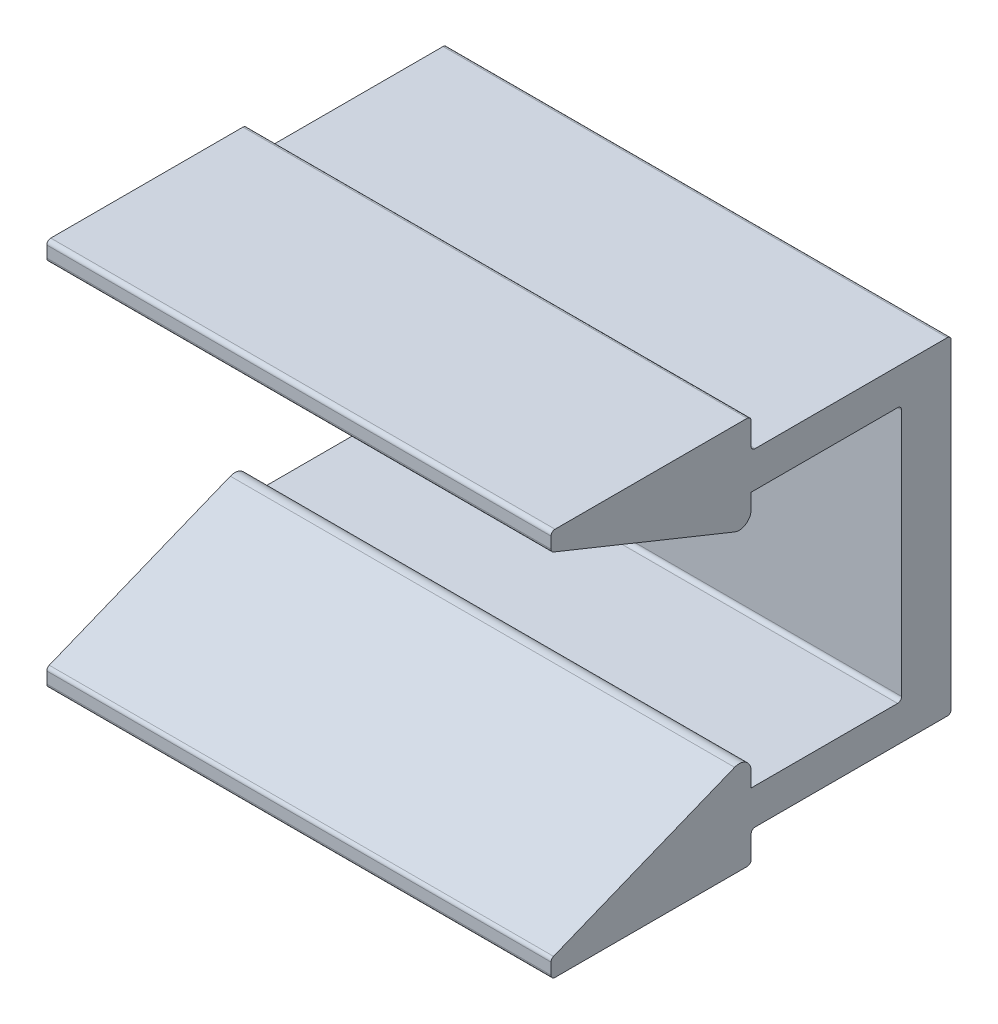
ISO-10303-21;
HEADER;
FILE_DESCRIPTION(('STEP AP214'),'2;1');
FILE_NAME('part.step','',(''),(''),'','','');
FILE_SCHEMA(('AUTOMOTIVE_DESIGN { 1 0 10303 214 1 1 1 1 }'));
ENDSEC;
DATA;
#1=APPLICATION_CONTEXT('core data for automotive mechanical design processes');
#2=APPLICATION_PROTOCOL_DEFINITION('international standard','automotive_design',2000,#1);
#3=PRODUCT_CONTEXT('',#1,'mechanical');
#4=PRODUCT('Part','Part','',(#3));
#5=PRODUCT_RELATED_PRODUCT_CATEGORY('part','',(#4));
#6=PRODUCT_DEFINITION_FORMATION('','',#4);
#7=PRODUCT_DEFINITION_CONTEXT('part definition',#1,'design');
#8=PRODUCT_DEFINITION('design','',#6,#7);
#9=PRODUCT_DEFINITION_SHAPE('','',#8);
#10=(LENGTH_UNIT() NAMED_UNIT(*) SI_UNIT(.MILLI.,.METRE.));
#11=(NAMED_UNIT(*) PLANE_ANGLE_UNIT() SI_UNIT($,.RADIAN.));
#12=(NAMED_UNIT(*) SI_UNIT($,.STERADIAN.) SOLID_ANGLE_UNIT());
#13=UNCERTAINTY_MEASURE_WITH_UNIT(LENGTH_MEASURE(1.E-05),#10,'distance_accuracy_value','');
#14=(GEOMETRIC_REPRESENTATION_CONTEXT(3) GLOBAL_UNCERTAINTY_ASSIGNED_CONTEXT((#13)) GLOBAL_UNIT_ASSIGNED_CONTEXT((#10,
#11,#12)) REPRESENTATION_CONTEXT('',''));
#15=CARTESIAN_POINT('',(0.,0.,0.));
#16=DIRECTION('',(0.,0.,1.));
#17=DIRECTION('',(1.,0.,0.));
#18=AXIS2_PLACEMENT_3D('',#15,#16,#17);
#19=CARTESIAN_POINT('',(8.001,-5.207,0.));
#20=DIRECTION('',(0.,0.,1.));
#21=DIRECTION('',(1.,0.,0.));
#22=AXIS2_PLACEMENT_3D('',#19,#20,#21);
#23=PLANE('',#22);
#24=DIRECTION('',(0.,1.,0.));
#25=VECTOR('',#24,1.);
#26=CARTESIAN_POINT('',(8.001,-5.207,0.));
#27=LINE('',#26,#25);
#28=CARTESIAN_POINT('',(8.001,-5.073,0.));
#29=VERTEX_POINT('',#28);
#30=CARTESIAN_POINT('',(8.001,5.073,0.));
#31=VERTEX_POINT('',#30);
#32=EDGE_CURVE('E361',#29,#31,#27,.T.);
#33=ORIENTED_EDGE('',*,*,#32,.F.);
#34=DIRECTION('',(1.,0.,0.));
#35=VECTOR('',#34,1.);
#36=CARTESIAN_POINT('',(-8.001,-5.073,0.));
#37=LINE('',#36,#35);
#38=CARTESIAN_POINT('',(-8.001,-5.073,0.));
#39=VERTEX_POINT('',#38);
#40=EDGE_CURVE('E281',#39,#29,#37,.T.);
#41=ORIENTED_EDGE('',*,*,#40,.F.);
#42=DIRECTION('',(0.,1.,0.));
#43=VECTOR('',#42,1.);
#44=CARTESIAN_POINT('',(-8.001,-5.207,0.));
#45=LINE('',#44,#43);
#46=CARTESIAN_POINT('',(-8.001,5.073,0.));
#47=VERTEX_POINT('',#46);
#48=EDGE_CURVE('E226',#39,#47,#45,.T.);
#49=ORIENTED_EDGE('',*,*,#48,.T.);
#50=DIRECTION('',(1.,0.,0.));
#51=VECTOR('',#50,1.);
#52=CARTESIAN_POINT('',(-8.001,5.073,0.));
#53=LINE('',#52,#51);
#54=EDGE_CURVE('E253',#47,#31,#53,.T.);
#55=ORIENTED_EDGE('',*,*,#54,.T.);
#56=EDGE_LOOP('',(#33,#41,#49,#55));
#57=FACE_BOUND('',#56,.T.);
#58=CARTESIAN_POINT('',(0.,0.,0.));
#59=DIRECTION('',(0.,0.,1.));
#60=DIRECTION('',(1.,0.,0.));
#61=AXIS2_PLACEMENT_3D('',#58,#59,#60);
#62=CIRCLE('',#61,2.1082);
#63=CARTESIAN_POINT('',(2.1082,0.,0.));
#64=VERTEX_POINT('',#63);
#65=EDGE_CURVE('E21',#64,#64,#62,.F.);
#66=ORIENTED_EDGE('',*,*,#65,.F.);
#67=EDGE_LOOP('',(#66));
#68=FACE_BOUND('',#67,.T.);
#69=ADVANCED_FACE('F17',(#57,#68),#23,.F.);
#70=CARTESIAN_POINT('',(8.001,3.937,1.5748));
#71=DIRECTION('',(0.,0.,-1.));
#72=DIRECTION('',(-1.,0.,0.));
#73=AXIS2_PLACEMENT_3D('',#70,#71,#72);
#74=PLANE('',#73);
#75=DIRECTION('',(0.,-1.,0.));
#76=VECTOR('',#75,1.);
#77=CARTESIAN_POINT('',(-8.001,3.937,1.5748));
#78=LINE('',#77,#76);
#79=CARTESIAN_POINT('',(-8.001,3.937,1.5748));
#80=VERTEX_POINT('',#79);
#81=CARTESIAN_POINT('',(-8.001,-3.937,1.5748));
#82=VERTEX_POINT('',#81);
#83=EDGE_CURVE('E293',#80,#82,#78,.T.);
#84=ORIENTED_EDGE('',*,*,#83,.T.);
#85=DIRECTION('',(-1.,0.,0.));
#86=VECTOR('',#85,1.);
#87=CARTESIAN_POINT('',(8.001,-3.937,1.5748));
#88=LINE('',#87,#86);
#89=CARTESIAN_POINT('',(8.001,-3.937,1.5748));
#90=VERTEX_POINT('',#89);
#91=EDGE_CURVE('E437',#90,#82,#88,.T.);
#92=ORIENTED_EDGE('',*,*,#91,.F.);
#93=DIRECTION('',(0.,-1.,0.));
#94=VECTOR('',#93,1.);
#95=CARTESIAN_POINT('',(8.001,3.937,1.5748));
#96=LINE('',#95,#94);
#97=CARTESIAN_POINT('',(8.001,3.937,1.5748));
#98=VERTEX_POINT('',#97);
#99=EDGE_CURVE('E337',#98,#90,#96,.T.);
#100=ORIENTED_EDGE('',*,*,#99,.F.);
#101=DIRECTION('',(-1.,0.,0.));
#102=VECTOR('',#101,1.);
#103=CARTESIAN_POINT('',(8.001,3.937,1.5748));
#104=LINE('',#103,#102);
#105=EDGE_CURVE('E26',#98,#80,#104,.T.);
#106=ORIENTED_EDGE('',*,*,#105,.T.);
#107=EDGE_LOOP('',(#84,#92,#100,#106));
#108=FACE_BOUND('',#107,.T.);
#109=CARTESIAN_POINT('',(0.,0.,1.5748));
#110=DIRECTION('',(0.,0.,-1.));
#111=DIRECTION('',(-1.,0.,0.));
#112=AXIS2_PLACEMENT_3D('',#109,#110,#111);
#113=CIRCLE('',#112,2.1082);
#114=CARTESIAN_POINT('',(-2.1082,0.,1.5748));
#115=VERTEX_POINT('',#114);
#116=EDGE_CURVE('E285',#115,#115,#113,.F.);
#117=ORIENTED_EDGE('',*,*,#116,.F.);
#118=EDGE_LOOP('',(#117));
#119=FACE_BOUND('',#118,.T.);
#120=ADVANCED_FACE('F445',(#108,#119),#74,.F.);
#121=CARTESIAN_POINT('',(8.001,4.064,6.35));
#122=DIRECTION('',(0.,1.,0.));
#123=DIRECTION('',(0.,0.,1.));
#124=AXIS2_PLACEMENT_3D('',#121,#122,#123);
#125=PLANE('',#124);
#126=DIRECTION('',(0.,0.,-1.));
#127=VECTOR('',#126,1.);
#128=CARTESIAN_POINT('',(-8.001,4.064,6.35));
#129=LINE('',#128,#127);
#130=CARTESIAN_POINT('',(-8.001,4.064,6.35));
#131=VERTEX_POINT('',#130);
#132=CARTESIAN_POINT('',(-8.001,4.064,1.7018));
#133=VERTEX_POINT('',#132);
#134=EDGE_CURVE('E288',#131,#133,#129,.T.);
#135=ORIENTED_EDGE('',*,*,#134,.T.);
#136=DIRECTION('',(-1.,0.,0.));
#137=VECTOR('',#136,1.);
#138=CARTESIAN_POINT('',(8.001,4.064,1.7018));
#139=LINE('',#138,#137);
#140=CARTESIAN_POINT('',(8.001,4.064,1.7018));
#141=VERTEX_POINT('',#140);
#142=EDGE_CURVE('E10',#141,#133,#139,.T.);
#143=ORIENTED_EDGE('',*,*,#142,.F.);
#144=DIRECTION('',(0.,0.,-1.));
#145=VECTOR('',#144,1.);
#146=CARTESIAN_POINT('',(8.001,4.064,6.35));
#147=LINE('',#146,#145);
#148=CARTESIAN_POINT('',(8.001,4.064,6.35));
#149=VERTEX_POINT('',#148);
#150=EDGE_CURVE('E333',#149,#141,#147,.T.);
#151=ORIENTED_EDGE('',*,*,#150,.F.);
#152=DIRECTION('',(-1.,0.,0.));
#153=VECTOR('',#152,1.);
#154=CARTESIAN_POINT('',(8.001,4.064,6.35));
#155=LINE('',#154,#153);
#156=EDGE_CURVE('E381',#149,#131,#155,.T.);
#157=ORIENTED_EDGE('',*,*,#156,.T.);
#158=EDGE_LOOP('',(#135,#143,#151,#157));
#159=FACE_BOUND('',#158,.T.);
#160=ADVANCED_FACE('F19',(#159),#125,.F.);
#161=CARTESIAN_POINT('',(8.001,3.937,1.7018));
#162=DIRECTION('',(-1.,0.,0.));
#163=DIRECTION('',(0.,-1.,0.));
#164=AXIS2_PLACEMENT_3D('',#161,#162,#163);
#165=CYLINDRICAL_SURFACE('',#164,0.127);
#166=CARTESIAN_POINT('',(-8.001,3.937,1.7018));
#167=DIRECTION('',(-1.,0.,0.));
#168=DIRECTION('',(0.,-1.,0.));
#169=AXIS2_PLACEMENT_3D('',#166,#167,#168);
#170=CIRCLE('',#169,0.127);
#171=EDGE_CURVE('E291',#133,#80,#170,.T.);
#172=ORIENTED_EDGE('',*,*,#171,.T.);
#173=ORIENTED_EDGE('',*,*,#105,.F.);
#174=CARTESIAN_POINT('',(8.001,3.937,1.7018));
#175=DIRECTION('',(-1.,0.,0.));
#176=DIRECTION('',(0.,-1.,0.));
#177=AXIS2_PLACEMENT_3D('',#174,#175,#176);
#178=CIRCLE('',#177,0.127);
#179=EDGE_CURVE('E335',#141,#98,#178,.T.);
#180=ORIENTED_EDGE('',*,*,#179,.F.);
#181=ORIENTED_EDGE('',*,*,#142,.T.);
#182=EDGE_LOOP('',(#172,#173,#180,#181));
#183=FACE_BOUND('',#182,.T.);
#184=ADVANCED_FACE('F466',(#183),#165,.F.);
#185=CARTESIAN_POINT('',(8.001,-3.937,1.7018));
#186=DIRECTION('',(-1.,0.,0.));
#187=DIRECTION('',(0.,-1.,0.));
#188=AXIS2_PLACEMENT_3D('',#185,#186,#187);
#189=CYLINDRICAL_SURFACE('',#188,0.127);
#190=CARTESIAN_POINT('',(-8.001,-3.937,1.7018));
#191=DIRECTION('',(-1.,0.,0.));
#192=DIRECTION('',(0.,1.,0.));
#193=AXIS2_PLACEMENT_3D('',#190,#191,#192);
#194=CIRCLE('',#193,0.127);
#195=CARTESIAN_POINT('',(-8.001,-4.064,1.7018));
#196=VERTEX_POINT('',#195);
#197=EDGE_CURVE('E295',#82,#196,#194,.T.);
#198=ORIENTED_EDGE('',*,*,#197,.T.);
#199=DIRECTION('',(-1.,0.,0.));
#200=VECTOR('',#199,1.);
#201=CARTESIAN_POINT('',(8.001,-4.064,1.7018));
#202=LINE('',#201,#200);
#203=CARTESIAN_POINT('',(8.001,-4.064,1.7018));
#204=VERTEX_POINT('',#203);
#205=EDGE_CURVE('E434',#204,#196,#202,.T.);
#206=ORIENTED_EDGE('',*,*,#205,.F.);
#207=CARTESIAN_POINT('',(8.001,-3.937,1.7018));
#208=DIRECTION('',(-1.,0.,0.));
#209=DIRECTION('',(0.,1.,0.));
#210=AXIS2_PLACEMENT_3D('',#207,#208,#209);
#211=CIRCLE('',#210,0.127);
#212=EDGE_CURVE('E339',#90,#204,#211,.T.);
#213=ORIENTED_EDGE('',*,*,#212,.F.);
#214=ORIENTED_EDGE('',*,*,#91,.T.);
#215=EDGE_LOOP('',(#198,#206,#213,#214));
#216=FACE_BOUND('',#215,.T.);
#217=ADVANCED_FACE('F455',(#216),#189,.F.);
#218=CARTESIAN_POINT('',(8.001,-4.064,6.35));
#219=DIRECTION('',(0.,-1.,0.));
#220=DIRECTION('',(0.,0.,-1.));
#221=AXIS2_PLACEMENT_3D('',#218,#219,#220);
#222=PLANE('',#221);
#223=DIRECTION('',(0.,0.,1.));
#224=VECTOR('',#223,1.);
#225=CARTESIAN_POINT('',(-8.001,-4.064,6.35));
#226=LINE('',#225,#224);
#227=CARTESIAN_POINT('',(-8.001,-4.064,6.35));
#228=VERTEX_POINT('',#227);
#229=EDGE_CURVE('E297',#196,#228,#226,.T.);
#230=ORIENTED_EDGE('',*,*,#229,.T.);
#231=DIRECTION('',(-1.,0.,0.));
#232=VECTOR('',#231,1.);
#233=CARTESIAN_POINT('',(8.001,-4.064,6.35));
#234=LINE('',#233,#232);
#235=CARTESIAN_POINT('',(8.001,-4.064,6.35));
#236=VERTEX_POINT('',#235);
#237=EDGE_CURVE('E431',#236,#228,#234,.T.);
#238=ORIENTED_EDGE('',*,*,#237,.F.);
#239=DIRECTION('',(0.,0.,1.));
#240=VECTOR('',#239,1.);
#241=CARTESIAN_POINT('',(8.001,-4.064,6.35));
#242=LINE('',#241,#240);
#243=EDGE_CURVE('E341',#204,#236,#242,.T.);
#244=ORIENTED_EDGE('',*,*,#243,.F.);
#245=ORIENTED_EDGE('',*,*,#205,.T.);
#246=EDGE_LOOP('',(#230,#238,#244,#245));
#247=FACE_BOUND('',#246,.T.);
#248=ADVANCED_FACE('F459',(#247),#222,.F.);
#249=CARTESIAN_POINT('',(8.001,-3.58728919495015,6.35));
#250=DIRECTION('',(0.,0.,1.));
#251=DIRECTION('',(1.,0.,0.));
#252=AXIS2_PLACEMENT_3D('',#249,#250,#251);
#253=PLANE('',#252);
#254=DIRECTION('',(0.,1.,0.));
#255=VECTOR('',#254,1.);
#256=CARTESIAN_POINT('',(-8.001,-3.58728919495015,6.35));
#257=LINE('',#256,#255);
#258=CARTESIAN_POINT('',(-8.001,-3.58728919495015,6.35));
#259=VERTEX_POINT('',#258);
#260=EDGE_CURVE('E299',#228,#259,#257,.T.);
#261=ORIENTED_EDGE('',*,*,#260,.T.);
#262=DIRECTION('',(-1.,0.,0.));
#263=VECTOR('',#262,1.);
#264=CARTESIAN_POINT('',(8.001,-3.58728919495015,6.35));
#265=LINE('',#264,#263);
#266=CARTESIAN_POINT('',(8.001,-3.58728919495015,6.35));
#267=VERTEX_POINT('',#266);
#268=EDGE_CURVE('E428',#267,#259,#265,.T.);
#269=ORIENTED_EDGE('',*,*,#268,.F.);
#270=DIRECTION('',(0.,1.,0.));
#271=VECTOR('',#270,1.);
#272=CARTESIAN_POINT('',(8.001,-3.58728919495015,6.35));
#273=LINE('',#272,#271);
#274=EDGE_CURVE('E343',#236,#267,#273,.T.);
#275=ORIENTED_EDGE('',*,*,#274,.F.);
#276=ORIENTED_EDGE('',*,*,#237,.T.);
#277=EDGE_LOOP('',(#261,#269,#275,#276));
#278=FACE_BOUND('',#277,.T.);
#279=ADVANCED_FACE('F568',(#278),#253,.F.);
#280=CARTESIAN_POINT('',(8.001,-3.58728919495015,6.731));
#281=DIRECTION('',(-1.,0.,0.));
#282=DIRECTION('',(0.,-1.,0.));
#283=AXIS2_PLACEMENT_3D('',#280,#281,#282);
#284=CYLINDRICAL_SURFACE('',#283,0.381);
#285=CARTESIAN_POINT('',(-8.001,-3.58728919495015,6.731));
#286=DIRECTION('',(1.,0.,0.));
#287=DIRECTION('',(0.,-1.,0.));
#288=AXIS2_PLACEMENT_3D('',#285,#286,#287);
#289=CIRCLE('',#288,0.381);
#290=CARTESIAN_POINT('',(-8.001,-3.2340321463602,6.87372511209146));
#291=VERTEX_POINT('',#290);
#292=EDGE_CURVE('E301',#259,#291,#289,.T.);
#293=ORIENTED_EDGE('',*,*,#292,.T.);
#294=DIRECTION('',(-1.,0.,0.));
#295=VECTOR('',#294,1.);
#296=CARTESIAN_POINT('',(8.001,-3.2340321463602,6.87372511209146));
#297=LINE('',#296,#295);
#298=CARTESIAN_POINT('',(8.001,-3.2340321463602,6.87372511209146));
#299=VERTEX_POINT('',#298);
#300=EDGE_CURVE('E425',#299,#291,#297,.T.);
#301=ORIENTED_EDGE('',*,*,#300,.F.);
#302=CARTESIAN_POINT('',(8.001,-3.58728919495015,6.731));
#303=DIRECTION('',(1.,0.,0.));
#304=DIRECTION('',(0.,-1.,0.));
#305=AXIS2_PLACEMENT_3D('',#302,#303,#304);
#306=CIRCLE('',#305,0.381);
#307=EDGE_CURVE('E345',#267,#299,#306,.T.);
#308=ORIENTED_EDGE('',*,*,#307,.F.);
#309=ORIENTED_EDGE('',*,*,#268,.T.);
#310=EDGE_LOOP('',(#293,#301,#308,#309));
#311=FACE_BOUND('',#310,.T.);
#312=ADVANCED_FACE('F566',(#311),#284,.T.);
#313=CARTESIAN_POINT('',(8.001,-5.55591023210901,12.6205750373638));
#314=DIRECTION('',(0.,-0.92718385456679,-0.374606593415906));
#315=DIRECTION('',(0.,0.374606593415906,-0.92718385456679));
#316=AXIS2_PLACEMENT_3D('',#313,#314,#315);
#317=PLANE('',#316);
#318=DIRECTION('',(0.,-0.374606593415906,0.92718385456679));
#319=VECTOR('',#318,1.);
#320=CARTESIAN_POINT('',(-8.001,-5.55591023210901,12.6205750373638));
#321=LINE('',#320,#319);
#322=CARTESIAN_POINT('',(-8.001,-5.55591023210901,12.6205750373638));
#323=VERTEX_POINT('',#322);
#324=EDGE_CURVE('E303',#291,#323,#321,.T.);
#325=ORIENTED_EDGE('',*,*,#324,.T.);
#326=DIRECTION('',(-1.,0.,0.));
#327=VECTOR('',#326,1.);
#328=CARTESIAN_POINT('',(8.001,-5.55591023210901,12.6205750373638));
#329=LINE('',#328,#327);
#330=CARTESIAN_POINT('',(8.001,-5.55591023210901,12.6205750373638));
#331=VERTEX_POINT('',#330);
#332=EDGE_CURVE('E422',#331,#323,#329,.T.);
#333=ORIENTED_EDGE('',*,*,#332,.F.);
#334=DIRECTION('',(0.,-0.374606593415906,0.92718385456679));
#335=VECTOR('',#334,1.);
#336=CARTESIAN_POINT('',(8.001,-5.55591023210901,12.6205750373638));
#337=LINE('',#336,#335);
#338=EDGE_CURVE('E347',#299,#331,#337,.T.);
#339=ORIENTED_EDGE('',*,*,#338,.F.);
#340=ORIENTED_EDGE('',*,*,#300,.T.);
#341=EDGE_LOOP('',(#325,#333,#339,#340));
#342=FACE_BOUND('',#341,.T.);
#343=ADVANCED_FACE('F562',(#342),#317,.F.);
#344=CARTESIAN_POINT('',(8.001,-5.67366258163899,12.573));
#345=DIRECTION('',(-1.,0.,0.));
#346=DIRECTION('',(0.,-1.,0.));
#347=AXIS2_PLACEMENT_3D('',#344,#345,#346);
#348=CYLINDRICAL_SURFACE('',#347,0.126999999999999);
#349=CARTESIAN_POINT('',(-8.001,-5.67366258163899,12.573));
#350=DIRECTION('',(1.,0.,0.));
#351=DIRECTION('',(0.,-1.,0.));
#352=AXIS2_PLACEMENT_3D('',#349,#350,#351);
#353=CIRCLE('',#352,0.126999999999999);
#354=CARTESIAN_POINT('',(-8.001,-5.67366258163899,12.7));
#355=VERTEX_POINT('',#354);
#356=EDGE_CURVE('E305',#323,#355,#353,.T.);
#357=ORIENTED_EDGE('',*,*,#356,.T.);
#358=DIRECTION('',(-1.,0.,0.));
#359=VECTOR('',#358,1.);
#360=CARTESIAN_POINT('',(8.001,-5.67366258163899,12.7));
#361=LINE('',#360,#359);
#362=CARTESIAN_POINT('',(8.001,-5.67366258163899,12.7));
#363=VERTEX_POINT('',#362);
#364=EDGE_CURVE('E419',#363,#355,#361,.T.);
#365=ORIENTED_EDGE('',*,*,#364,.F.);
#366=CARTESIAN_POINT('',(8.001,-5.67366258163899,12.573));
#367=DIRECTION('',(1.,0.,0.));
#368=DIRECTION('',(0.,-1.,0.));
#369=AXIS2_PLACEMENT_3D('',#366,#367,#368);
#370=CIRCLE('',#369,0.126999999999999);
#371=EDGE_CURVE('E349',#331,#363,#370,.T.);
#372=ORIENTED_EDGE('',*,*,#371,.F.);
#373=ORIENTED_EDGE('',*,*,#332,.T.);
#374=EDGE_LOOP('',(#357,#365,#372,#373));
#375=FACE_BOUND('',#374,.T.);
#376=ADVANCED_FACE('F557',(#375),#348,.T.);
#377=CARTESIAN_POINT('',(8.001,-6.0325,12.7));
#378=DIRECTION('',(0.,0.,-1.));
#379=DIRECTION('',(0.,1.,0.));
#380=AXIS2_PLACEMENT_3D('',#377,#378,#379);
#381=PLANE('',#380);
#382=DIRECTION('',(0.,-1.,0.));
#383=VECTOR('',#382,1.);
#384=CARTESIAN_POINT('',(-8.001,-6.0325,12.7));
#385=LINE('',#384,#383);
#386=CARTESIAN_POINT('',(-8.001,-6.0325,12.7));
#387=VERTEX_POINT('',#386);
#388=EDGE_CURVE('E307',#355,#387,#385,.T.);
#389=ORIENTED_EDGE('',*,*,#388,.T.);
#390=DIRECTION('',(-1.,0.,0.));
#391=VECTOR('',#390,1.);
#392=CARTESIAN_POINT('',(8.001,-6.0325,12.7));
#393=LINE('',#392,#391);
#394=CARTESIAN_POINT('',(8.001,-6.0325,12.7));
#395=VERTEX_POINT('',#394);
#396=EDGE_CURVE('E416',#395,#387,#393,.T.);
#397=ORIENTED_EDGE('',*,*,#396,.F.);
#398=DIRECTION('',(0.,-1.,0.));
#399=VECTOR('',#398,1.);
#400=CARTESIAN_POINT('',(8.001,-6.0325,12.7));
#401=LINE('',#400,#399);
#402=EDGE_CURVE('E351',#363,#395,#401,.T.);
#403=ORIENTED_EDGE('',*,*,#402,.F.);
#404=ORIENTED_EDGE('',*,*,#364,.T.);
#405=EDGE_LOOP('',(#389,#397,#403,#404));
#406=FACE_BOUND('',#405,.T.);
#407=ADVANCED_FACE('F551',(#406),#381,.F.);
#408=CARTESIAN_POINT('',(8.001,-6.0325,12.573));
#409=DIRECTION('',(-1.,0.,0.));
#410=DIRECTION('',(0.,-1.,0.));
#411=AXIS2_PLACEMENT_3D('',#408,#409,#410);
#412=CYLINDRICAL_SURFACE('',#411,0.127000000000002);
#413=CARTESIAN_POINT('',(-8.001,-6.0325,12.573));
#414=DIRECTION('',(1.,0.,0.));
#415=DIRECTION('',(0.,-1.,0.));
#416=AXIS2_PLACEMENT_3D('',#413,#414,#415);
#417=CIRCLE('',#416,0.127000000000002);
#418=CARTESIAN_POINT('',(-8.001,-6.1595,12.573));
#419=VERTEX_POINT('',#418);
#420=EDGE_CURVE('E309',#387,#419,#417,.T.);
#421=ORIENTED_EDGE('',*,*,#420,.T.);
#422=DIRECTION('',(-1.,0.,0.));
#423=VECTOR('',#422,1.);
#424=CARTESIAN_POINT('',(8.001,-6.1595,12.573));
#425=LINE('',#424,#423);
#426=CARTESIAN_POINT('',(8.001,-6.1595,12.573));
#427=VERTEX_POINT('',#426);
#428=EDGE_CURVE('E413',#427,#419,#425,.T.);
#429=ORIENTED_EDGE('',*,*,#428,.F.);
#430=CARTESIAN_POINT('',(8.001,-6.0325,12.573));
#431=DIRECTION('',(1.,0.,0.));
#432=DIRECTION('',(0.,-1.,0.));
#433=AXIS2_PLACEMENT_3D('',#430,#431,#432);
#434=CIRCLE('',#433,0.127000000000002);
#435=EDGE_CURVE('E353',#395,#427,#434,.T.);
#436=ORIENTED_EDGE('',*,*,#435,.F.);
#437=ORIENTED_EDGE('',*,*,#396,.T.);
#438=EDGE_LOOP('',(#421,#429,#436,#437));
#439=FACE_BOUND('',#438,.T.);
#440=ADVANCED_FACE('F547',(#439),#412,.T.);
#441=CARTESIAN_POINT('',(8.001,-6.1595,6.477));
#442=DIRECTION('',(0.,1.,0.));
#443=DIRECTION('',(0.,0.,1.));
#444=AXIS2_PLACEMENT_3D('',#441,#442,#443);
#445=PLANE('',#444);
#446=DIRECTION('',(0.,0.,-1.));
#447=VECTOR('',#446,1.);
#448=CARTESIAN_POINT('',(-8.001,-6.1595,6.477));
#449=LINE('',#448,#447);
#450=CARTESIAN_POINT('',(-8.001,-6.1595,6.477));
#451=VERTEX_POINT('',#450);
#452=EDGE_CURVE('E311',#419,#451,#449,.T.);
#453=ORIENTED_EDGE('',*,*,#452,.T.);
#454=DIRECTION('',(-1.,0.,0.));
#455=VECTOR('',#454,1.);
#456=CARTESIAN_POINT('',(8.001,-6.1595,6.477));
#457=LINE('',#456,#455);
#458=CARTESIAN_POINT('',(8.001,-6.1595,6.477));
#459=VERTEX_POINT('',#458);
#460=EDGE_CURVE('E410',#459,#451,#457,.T.);
#461=ORIENTED_EDGE('',*,*,#460,.F.);
#462=DIRECTION('',(0.,0.,-1.));
#463=VECTOR('',#462,1.);
#464=CARTESIAN_POINT('',(8.001,-6.1595,6.477));
#465=LINE('',#464,#463);
#466=EDGE_CURVE('E355',#427,#459,#465,.T.);
#467=ORIENTED_EDGE('',*,*,#466,.F.);
#468=ORIENTED_EDGE('',*,*,#428,.T.);
#469=EDGE_LOOP('',(#453,#461,#467,#468));
#470=FACE_BOUND('',#469,.T.);
#471=ADVANCED_FACE('F542',(#470),#445,.F.);
#472=CARTESIAN_POINT('',(8.001,-6.0325,6.477));
#473=DIRECTION('',(-1.,0.,0.));
#474=DIRECTION('',(0.,-1.,0.));
#475=AXIS2_PLACEMENT_3D('',#472,#473,#474);
#476=CYLINDRICAL_SURFACE('',#475,0.127);
#477=CARTESIAN_POINT('',(-8.001,-6.0325,6.477));
#478=DIRECTION('',(1.,0.,0.));
#479=DIRECTION('',(0.,-1.,0.));
#480=AXIS2_PLACEMENT_3D('',#477,#478,#479);
#481=CIRCLE('',#480,0.127);
#482=CARTESIAN_POINT('',(-8.001,-6.0325,6.35));
#483=VERTEX_POINT('',#482);
#484=EDGE_CURVE('E313',#451,#483,#481,.T.);
#485=ORIENTED_EDGE('',*,*,#484,.T.);
#486=DIRECTION('',(-1.,0.,0.));
#487=VECTOR('',#486,1.);
#488=CARTESIAN_POINT('',(8.001,-6.0325,6.35));
#489=LINE('',#488,#487);
#490=CARTESIAN_POINT('',(8.001,-6.0325,6.35));
#491=VERTEX_POINT('',#490);
#492=EDGE_CURVE('E407',#491,#483,#489,.T.);
#493=ORIENTED_EDGE('',*,*,#492,.F.);
#494=CARTESIAN_POINT('',(8.001,-6.0325,6.477));
#495=DIRECTION('',(1.,0.,0.));
#496=DIRECTION('',(0.,-1.,0.));
#497=AXIS2_PLACEMENT_3D('',#494,#495,#496);
#498=CIRCLE('',#497,0.127);
#499=EDGE_CURVE('E357',#459,#491,#498,.T.);
#500=ORIENTED_EDGE('',*,*,#499,.F.);
#501=ORIENTED_EDGE('',*,*,#460,.T.);
#502=EDGE_LOOP('',(#485,#493,#500,#501));
#503=FACE_BOUND('',#502,.T.);
#504=ADVANCED_FACE('F536',(#503),#476,.T.);
#505=CARTESIAN_POINT('',(8.001,-5.461,6.35));
#506=DIRECTION('',(0.,0.,1.));
#507=DIRECTION('',(1.,0.,0.));
#508=AXIS2_PLACEMENT_3D('',#505,#506,#507);
#509=PLANE('',#508);
#510=DIRECTION('',(0.,1.,0.));
#511=VECTOR('',#510,1.);
#512=CARTESIAN_POINT('',(-8.001,-5.461,6.35));
#513=LINE('',#512,#511);
#514=CARTESIAN_POINT('',(-8.001,-5.327,6.35));
#515=VERTEX_POINT('',#514);
#516=EDGE_CURVE('E315',#483,#515,#513,.T.);
#517=ORIENTED_EDGE('',*,*,#516,.T.);
#518=DIRECTION('',(1.,0.,0.));
#519=VECTOR('',#518,1.);
#520=CARTESIAN_POINT('',(-8.001,-5.327,6.35));
#521=LINE('',#520,#519);
#522=CARTESIAN_POINT('',(8.001,-5.327,6.35));
#523=VERTEX_POINT('',#522);
#524=EDGE_CURVE('E269',#515,#523,#521,.T.);
#525=ORIENTED_EDGE('',*,*,#524,.T.);
#526=DIRECTION('',(0.,1.,0.));
#527=VECTOR('',#526,1.);
#528=CARTESIAN_POINT('',(8.001,-5.461,6.35));
#529=LINE('',#528,#527);
#530=EDGE_CURVE('E359',#491,#523,#529,.T.);
#531=ORIENTED_EDGE('',*,*,#530,.F.);
#532=ORIENTED_EDGE('',*,*,#492,.T.);
#533=EDGE_LOOP('',(#517,#525,#531,#532));
#534=FACE_BOUND('',#533,.T.);
#535=ADVANCED_FACE('F532',(#534),#509,.F.);
#536=CARTESIAN_POINT('',(8.001,5.461,6.35));
#537=DIRECTION('',(0.,0.,1.));
#538=DIRECTION('',(1.,0.,0.));
#539=AXIS2_PLACEMENT_3D('',#536,#537,#538);
#540=PLANE('',#539);
#541=DIRECTION('',(-1.,0.,0.));
#542=VECTOR('',#541,1.);
#543=CARTESIAN_POINT('',(8.001,6.0325,6.35));
#544=LINE('',#543,#542);
#545=CARTESIAN_POINT('',(8.001,6.0325,6.35));
#546=VERTEX_POINT('',#545);
#547=CARTESIAN_POINT('',(-8.001,6.0325,6.35));
#548=VERTEX_POINT('',#547);
#549=EDGE_CURVE('E405',#546,#548,#544,.T.);
#550=ORIENTED_EDGE('',*,*,#549,.F.);
#551=DIRECTION('',(0.,1.,0.));
#552=VECTOR('',#551,1.);
#553=CARTESIAN_POINT('',(8.001,5.461,6.35));
#554=LINE('',#553,#552);
#555=CARTESIAN_POINT('',(8.001,5.327,6.35));
#556=VERTEX_POINT('',#555);
#557=EDGE_CURVE('E231',#556,#546,#554,.T.);
#558=ORIENTED_EDGE('',*,*,#557,.F.);
#559=DIRECTION('',(1.,0.,0.));
#560=VECTOR('',#559,1.);
#561=CARTESIAN_POINT('',(-8.001,5.327,6.35));
#562=LINE('',#561,#560);
#563=CARTESIAN_POINT('',(-8.001,5.327,6.35));
#564=VERTEX_POINT('',#563);
#565=EDGE_CURVE('E229',#564,#556,#562,.T.);
#566=ORIENTED_EDGE('',*,*,#565,.F.);
#567=DIRECTION('',(0.,1.,0.));
#568=VECTOR('',#567,1.);
#569=CARTESIAN_POINT('',(-8.001,5.461,6.35));
#570=LINE('',#569,#568);
#571=EDGE_CURVE('E216',#564,#548,#570,.T.);
#572=ORIENTED_EDGE('',*,*,#571,.T.);
#573=EDGE_LOOP('',(#550,#558,#566,#572));
#574=FACE_BOUND('',#573,.T.);
#575=ADVANCED_FACE('F230',(#574),#540,.F.);
#576=CARTESIAN_POINT('',(8.001,6.0325,6.477));
#577=DIRECTION('',(-1.,0.,0.));
#578=DIRECTION('',(0.,-1.,0.));
#579=AXIS2_PLACEMENT_3D('',#576,#577,#578);
#580=CYLINDRICAL_SURFACE('',#579,0.127);
#581=CARTESIAN_POINT('',(-8.001,6.0325,6.477));
#582=DIRECTION('',(1.,0.,0.));
#583=DIRECTION('',(0.,1.,0.));
#584=AXIS2_PLACEMENT_3D('',#581,#582,#583);
#585=CIRCLE('',#584,0.127);
#586=CARTESIAN_POINT('',(-8.001,6.1595,6.477));
#587=VERTEX_POINT('',#586);
#588=EDGE_CURVE('E222',#548,#587,#585,.T.);
#589=ORIENTED_EDGE('',*,*,#588,.T.);
#590=DIRECTION('',(-1.,0.,0.));
#591=VECTOR('',#590,1.);
#592=CARTESIAN_POINT('',(8.001,6.1595,6.477));
#593=LINE('',#592,#591);
#594=CARTESIAN_POINT('',(8.001,6.1595,6.477));
#595=VERTEX_POINT('',#594);
#596=EDGE_CURVE('E402',#595,#587,#593,.T.);
#597=ORIENTED_EDGE('',*,*,#596,.F.);
#598=CARTESIAN_POINT('',(8.001,6.0325,6.477));
#599=DIRECTION('',(1.,0.,0.));
#600=DIRECTION('',(0.,1.,0.));
#601=AXIS2_PLACEMENT_3D('',#598,#599,#600);
#602=CIRCLE('',#601,0.127);
#603=EDGE_CURVE('E366',#546,#595,#602,.T.);
#604=ORIENTED_EDGE('',*,*,#603,.F.);
#605=ORIENTED_EDGE('',*,*,#549,.T.);
#606=EDGE_LOOP('',(#589,#597,#604,#605));
#607=FACE_BOUND('',#606,.T.);
#608=ADVANCED_FACE('F503',(#607),#580,.T.);
#609=CARTESIAN_POINT('',(8.001,6.1595,6.477));
#610=DIRECTION('',(0.,-1.,0.));
#611=DIRECTION('',(0.,0.,-1.));
#612=AXIS2_PLACEMENT_3D('',#609,#610,#611);
#613=PLANE('',#612);
#614=DIRECTION('',(0.,0.,1.));
#615=VECTOR('',#614,1.);
#616=CARTESIAN_POINT('',(-8.001,6.1595,6.477));
#617=LINE('',#616,#615);
#618=CARTESIAN_POINT('',(-8.001,6.1595,12.573));
#619=VERTEX_POINT('',#618);
#620=EDGE_CURVE('E319',#587,#619,#617,.T.);
#621=ORIENTED_EDGE('',*,*,#620,.T.);
#622=DIRECTION('',(-1.,0.,0.));
#623=VECTOR('',#622,1.);
#624=CARTESIAN_POINT('',(8.001,6.1595,12.573));
#625=LINE('',#624,#623);
#626=CARTESIAN_POINT('',(8.001,6.1595,12.573));
#627=VERTEX_POINT('',#626);
#628=EDGE_CURVE('E399',#627,#619,#625,.T.);
#629=ORIENTED_EDGE('',*,*,#628,.F.);
#630=DIRECTION('',(0.,0.,1.));
#631=VECTOR('',#630,1.);
#632=CARTESIAN_POINT('',(8.001,6.1595,6.477));
#633=LINE('',#632,#631);
#634=EDGE_CURVE('E368',#595,#627,#633,.T.);
#635=ORIENTED_EDGE('',*,*,#634,.F.);
#636=ORIENTED_EDGE('',*,*,#596,.T.);
#637=EDGE_LOOP('',(#621,#629,#635,#636));
#638=FACE_BOUND('',#637,.T.);
#639=ADVANCED_FACE('F498',(#638),#613,.F.);
#640=CARTESIAN_POINT('',(8.001,6.0325,12.573));
#641=DIRECTION('',(-1.,0.,0.));
#642=DIRECTION('',(0.,-1.,0.));
#643=AXIS2_PLACEMENT_3D('',#640,#641,#642);
#644=CYLINDRICAL_SURFACE('',#643,0.127000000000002);
#645=CARTESIAN_POINT('',(-8.001,6.0325,12.573));
#646=DIRECTION('',(1.,0.,0.));
#647=DIRECTION('',(0.,1.,0.));
#648=AXIS2_PLACEMENT_3D('',#645,#646,#647);
#649=CIRCLE('',#648,0.127000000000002);
#650=CARTESIAN_POINT('',(-8.001,6.0325,12.7));
#651=VERTEX_POINT('',#650);
#652=EDGE_CURVE('E321',#619,#651,#649,.T.);
#653=ORIENTED_EDGE('',*,*,#652,.T.);
#654=DIRECTION('',(-1.,0.,0.));
#655=VECTOR('',#654,1.);
#656=CARTESIAN_POINT('',(8.001,6.0325,12.7));
#657=LINE('',#656,#655);
#658=CARTESIAN_POINT('',(8.001,6.0325,12.7));
#659=VERTEX_POINT('',#658);
#660=EDGE_CURVE('E396',#659,#651,#657,.T.);
#661=ORIENTED_EDGE('',*,*,#660,.F.);
#662=CARTESIAN_POINT('',(8.001,6.0325,12.573));
#663=DIRECTION('',(1.,0.,0.));
#664=DIRECTION('',(0.,1.,0.));
#665=AXIS2_PLACEMENT_3D('',#662,#663,#664);
#666=CIRCLE('',#665,0.127000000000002);
#667=EDGE_CURVE('E370',#627,#659,#666,.T.);
#668=ORIENTED_EDGE('',*,*,#667,.F.);
#669=ORIENTED_EDGE('',*,*,#628,.T.);
#670=EDGE_LOOP('',(#653,#661,#668,#669));
#671=FACE_BOUND('',#670,.T.);
#672=ADVANCED_FACE('F495',(#671),#644,.T.);
#673=CARTESIAN_POINT('',(8.001,6.0325,12.7));
#674=DIRECTION('',(0.,0.,-1.));
#675=DIRECTION('',(0.,1.,0.));
#676=AXIS2_PLACEMENT_3D('',#673,#674,#675);
#677=PLANE('',#676);
#678=DIRECTION('',(0.,-1.,0.));
#679=VECTOR('',#678,1.);
#680=CARTESIAN_POINT('',(-8.001,6.0325,12.7));
#681=LINE('',#680,#679);
#682=CARTESIAN_POINT('',(-8.001,5.67366258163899,12.7));
#683=VERTEX_POINT('',#682);
#684=EDGE_CURVE('E323',#651,#683,#681,.T.);
#685=ORIENTED_EDGE('',*,*,#684,.T.);
#686=DIRECTION('',(-1.,0.,0.));
#687=VECTOR('',#686,1.);
#688=CARTESIAN_POINT('',(8.001,5.67366258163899,12.7));
#689=LINE('',#688,#687);
#690=CARTESIAN_POINT('',(8.001,5.67366258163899,12.7));
#691=VERTEX_POINT('',#690);
#692=EDGE_CURVE('E393',#691,#683,#689,.T.);
#693=ORIENTED_EDGE('',*,*,#692,.F.);
#694=DIRECTION('',(0.,-1.,0.));
#695=VECTOR('',#694,1.);
#696=CARTESIAN_POINT('',(8.001,6.0325,12.7));
#697=LINE('',#696,#695);
#698=EDGE_CURVE('E372',#659,#691,#697,.T.);
#699=ORIENTED_EDGE('',*,*,#698,.F.);
#700=ORIENTED_EDGE('',*,*,#660,.T.);
#701=EDGE_LOOP('',(#685,#693,#699,#700));
#702=FACE_BOUND('',#701,.T.);
#703=ADVANCED_FACE('F491',(#702),#677,.F.);
#704=CARTESIAN_POINT('',(8.001,5.67366258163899,12.573));
#705=DIRECTION('',(-1.,0.,0.));
#706=DIRECTION('',(0.,-1.,0.));
#707=AXIS2_PLACEMENT_3D('',#704,#705,#706);
#708=CYLINDRICAL_SURFACE('',#707,0.126999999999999);
#709=CARTESIAN_POINT('',(-8.001,5.67366258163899,12.573));
#710=DIRECTION('',(1.,0.,0.));
#711=DIRECTION('',(0.,1.,0.));
#712=AXIS2_PLACEMENT_3D('',#709,#710,#711);
#713=CIRCLE('',#712,0.126999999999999);
#714=CARTESIAN_POINT('',(-8.001,5.55591023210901,12.6205750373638));
#715=VERTEX_POINT('',#714);
#716=EDGE_CURVE('E325',#683,#715,#713,.T.);
#717=ORIENTED_EDGE('',*,*,#716,.T.);
#718=DIRECTION('',(-1.,0.,0.));
#719=VECTOR('',#718,1.);
#720=CARTESIAN_POINT('',(8.001,5.55591023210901,12.6205750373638));
#721=LINE('',#720,#719);
#722=CARTESIAN_POINT('',(8.001,5.55591023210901,12.6205750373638));
#723=VERTEX_POINT('',#722);
#724=EDGE_CURVE('E390',#723,#715,#721,.T.);
#725=ORIENTED_EDGE('',*,*,#724,.F.);
#726=CARTESIAN_POINT('',(8.001,5.67366258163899,12.573));
#727=DIRECTION('',(1.,0.,0.));
#728=DIRECTION('',(0.,1.,0.));
#729=AXIS2_PLACEMENT_3D('',#726,#727,#728);
#730=CIRCLE('',#729,0.126999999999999);
#731=EDGE_CURVE('E374',#691,#723,#730,.T.);
#732=ORIENTED_EDGE('',*,*,#731,.F.);
#733=ORIENTED_EDGE('',*,*,#692,.T.);
#734=EDGE_LOOP('',(#717,#725,#732,#733));
#735=FACE_BOUND('',#734,.T.);
#736=ADVANCED_FACE('F486',(#735),#708,.T.);
#737=CARTESIAN_POINT('',(8.001,5.55591023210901,12.6205750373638));
#738=DIRECTION('',(0.,0.92718385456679,-0.374606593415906));
#739=DIRECTION('',(0.,0.374606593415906,0.92718385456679));
#740=AXIS2_PLACEMENT_3D('',#737,#738,#739);
#741=PLANE('',#740);
#742=DIRECTION('',(0.,-0.374606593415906,-0.92718385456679));
#743=VECTOR('',#742,1.);
#744=CARTESIAN_POINT('',(-8.001,5.55591023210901,12.6205750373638));
#745=LINE('',#744,#743);
#746=CARTESIAN_POINT('',(-8.001,3.2340321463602,6.87372511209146));
#747=VERTEX_POINT('',#746);
#748=EDGE_CURVE('E327',#715,#747,#745,.T.);
#749=ORIENTED_EDGE('',*,*,#748,.T.);
#750=DIRECTION('',(-1.,0.,0.));
#751=VECTOR('',#750,1.);
#752=CARTESIAN_POINT('',(8.001,3.2340321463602,6.87372511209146));
#753=LINE('',#752,#751);
#754=CARTESIAN_POINT('',(8.001,3.2340321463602,6.87372511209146));
#755=VERTEX_POINT('',#754);
#756=EDGE_CURVE('E387',#755,#747,#753,.T.);
#757=ORIENTED_EDGE('',*,*,#756,.F.);
#758=DIRECTION('',(0.,-0.374606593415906,-0.92718385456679));
#759=VECTOR('',#758,1.);
#760=CARTESIAN_POINT('',(8.001,5.55591023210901,12.6205750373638));
#761=LINE('',#760,#759);
#762=EDGE_CURVE('E376',#723,#755,#761,.T.);
#763=ORIENTED_EDGE('',*,*,#762,.F.);
#764=ORIENTED_EDGE('',*,*,#724,.T.);
#765=EDGE_LOOP('',(#749,#757,#763,#764));
#766=FACE_BOUND('',#765,.T.);
#767=ADVANCED_FACE('F480',(#766),#741,.F.);
#768=CARTESIAN_POINT('',(8.001,3.58728919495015,6.731));
#769=DIRECTION('',(-1.,0.,0.));
#770=DIRECTION('',(0.,-1.,0.));
#771=AXIS2_PLACEMENT_3D('',#768,#769,#770);
#772=CYLINDRICAL_SURFACE('',#771,0.381);
#773=CARTESIAN_POINT('',(-8.001,3.58728919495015,6.731));
#774=DIRECTION('',(1.,0.,0.));
#775=DIRECTION('',(0.,1.,0.));
#776=AXIS2_PLACEMENT_3D('',#773,#774,#775);
#777=CIRCLE('',#776,0.381);
#778=CARTESIAN_POINT('',(-8.001,3.58728919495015,6.35));
#779=VERTEX_POINT('',#778);
#780=EDGE_CURVE('E329',#747,#779,#777,.T.);
#781=ORIENTED_EDGE('',*,*,#780,.T.);
#782=DIRECTION('',(-1.,0.,0.));
#783=VECTOR('',#782,1.);
#784=CARTESIAN_POINT('',(8.001,3.58728919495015,6.35));
#785=LINE('',#784,#783);
#786=CARTESIAN_POINT('',(8.001,3.58728919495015,6.35));
#787=VERTEX_POINT('',#786);
#788=EDGE_CURVE('E384',#787,#779,#785,.T.);
#789=ORIENTED_EDGE('',*,*,#788,.F.);
#790=CARTESIAN_POINT('',(8.001,3.58728919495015,6.731));
#791=DIRECTION('',(1.,0.,0.));
#792=DIRECTION('',(0.,1.,0.));
#793=AXIS2_PLACEMENT_3D('',#790,#791,#792);
#794=CIRCLE('',#793,0.381);
#795=EDGE_CURVE('E378',#755,#787,#794,.T.);
#796=ORIENTED_EDGE('',*,*,#795,.F.);
#797=ORIENTED_EDGE('',*,*,#756,.T.);
#798=EDGE_LOOP('',(#781,#789,#796,#797));
#799=FACE_BOUND('',#798,.T.);
#800=ADVANCED_FACE('F476',(#799),#772,.T.);
#801=CARTESIAN_POINT('',(8.001,3.58728919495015,6.35));
#802=DIRECTION('',(0.,0.,1.));
#803=DIRECTION('',(1.,0.,0.));
#804=AXIS2_PLACEMENT_3D('',#801,#802,#803);
#805=PLANE('',#804);
#806=DIRECTION('',(0.,1.,0.));
#807=VECTOR('',#806,1.);
#808=CARTESIAN_POINT('',(-8.001,3.58728919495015,6.35));
#809=LINE('',#808,#807);
#810=EDGE_CURVE('E331',#779,#131,#809,.T.);
#811=ORIENTED_EDGE('',*,*,#810,.T.);
#812=ORIENTED_EDGE('',*,*,#156,.F.);
#813=DIRECTION('',(0.,1.,0.));
#814=VECTOR('',#813,1.);
#815=CARTESIAN_POINT('',(8.001,3.58728919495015,6.35));
#816=LINE('',#815,#814);
#817=EDGE_CURVE('E41',#787,#149,#816,.T.);
#818=ORIENTED_EDGE('',*,*,#817,.F.);
#819=ORIENTED_EDGE('',*,*,#788,.T.);
#820=EDGE_LOOP('',(#811,#812,#818,#819));
#821=FACE_BOUND('',#820,.T.);
#822=ADVANCED_FACE('F472',(#821),#805,.F.);
#823=CARTESIAN_POINT('',(8.001,3.937,1.7018));
#824=DIRECTION('',(-1.,0.,0.));
#825=DIRECTION('',(0.,-1.,0.));
#826=AXIS2_PLACEMENT_3D('',#823,#824,#825);
#827=PLANE('',#826);
#828=CARTESIAN_POINT('',(8.001,5.327,6.223));
#829=DIRECTION('',(1.,0.,0.));
#830=DIRECTION('',(0.,0.,1.));
#831=AXIS2_PLACEMENT_3D('',#828,#829,#830);
#832=CIRCLE('',#831,0.127);
#833=CARTESIAN_POINT('',(8.001,5.2,6.223));
#834=VERTEX_POINT('',#833);
#835=EDGE_CURVE('E248',#556,#834,#832,.T.);
#836=ORIENTED_EDGE('',*,*,#835,.F.);
#837=ORIENTED_EDGE('',*,*,#557,.T.);
#838=ORIENTED_EDGE('',*,*,#603,.T.);
#839=ORIENTED_EDGE('',*,*,#634,.T.);
#840=ORIENTED_EDGE('',*,*,#667,.T.);
#841=ORIENTED_EDGE('',*,*,#698,.T.);
#842=ORIENTED_EDGE('',*,*,#731,.T.);
#843=ORIENTED_EDGE('',*,*,#762,.T.);
#844=ORIENTED_EDGE('',*,*,#795,.T.);
#845=ORIENTED_EDGE('',*,*,#817,.T.);
#846=ORIENTED_EDGE('',*,*,#150,.T.);
#847=ORIENTED_EDGE('',*,*,#179,.T.);
#848=ORIENTED_EDGE('',*,*,#99,.T.);
#849=ORIENTED_EDGE('',*,*,#212,.T.);
#850=ORIENTED_EDGE('',*,*,#243,.T.);
#851=ORIENTED_EDGE('',*,*,#274,.T.);
#852=ORIENTED_EDGE('',*,*,#307,.T.);
#853=ORIENTED_EDGE('',*,*,#338,.T.);
#854=ORIENTED_EDGE('',*,*,#371,.T.);
#855=ORIENTED_EDGE('',*,*,#402,.T.);
#856=ORIENTED_EDGE('',*,*,#435,.T.);
#857=ORIENTED_EDGE('',*,*,#466,.T.);
#858=ORIENTED_EDGE('',*,*,#499,.T.);
#859=ORIENTED_EDGE('',*,*,#530,.T.);
#860=CARTESIAN_POINT('',(8.001,-5.327,6.223));
#861=DIRECTION('',(1.,0.,0.));
#862=DIRECTION('',(0.,0.,-1.));
#863=AXIS2_PLACEMENT_3D('',#860,#861,#862);
#864=CIRCLE('',#863,0.127);
#865=CARTESIAN_POINT('',(8.001,-5.2,6.223));
#866=VERTEX_POINT('',#865);
#867=EDGE_CURVE('E270',#866,#523,#864,.T.);
#868=ORIENTED_EDGE('',*,*,#867,.F.);
#869=DIRECTION('',(0.,0.,1.));
#870=VECTOR('',#869,1.);
#871=CARTESIAN_POINT('',(8.001,-5.2,6.223));
#872=LINE('',#871,#870);
#873=CARTESIAN_POINT('',(8.001,-5.2,0.127));
#874=VERTEX_POINT('',#873);
#875=EDGE_CURVE('E263',#874,#866,#872,.T.);
#876=ORIENTED_EDGE('',*,*,#875,.F.);
#877=CARTESIAN_POINT('',(8.001,-5.073,0.127));
#878=DIRECTION('',(-1.,0.,0.));
#879=DIRECTION('',(0.,0.,1.));
#880=AXIS2_PLACEMENT_3D('',#877,#878,#879);
#881=CIRCLE('',#880,0.127);
#882=EDGE_CURVE('E273',#29,#874,#881,.T.);
#883=ORIENTED_EDGE('',*,*,#882,.F.);
#884=ORIENTED_EDGE('',*,*,#32,.T.);
#885=CARTESIAN_POINT('',(8.001,5.073,0.127));
#886=DIRECTION('',(-1.,0.,0.));
#887=DIRECTION('',(0.,0.,-1.));
#888=AXIS2_PLACEMENT_3D('',#885,#886,#887);
#889=CIRCLE('',#888,0.127);
#890=CARTESIAN_POINT('',(8.001,5.2,0.127));
#891=VERTEX_POINT('',#890);
#892=EDGE_CURVE('E239',#891,#31,#889,.T.);
#893=ORIENTED_EDGE('',*,*,#892,.F.);
#894=DIRECTION('',(0.,0.,-1.));
#895=VECTOR('',#894,1.);
#896=CARTESIAN_POINT('',(8.001,5.2,6.223));
#897=LINE('',#896,#895);
#898=EDGE_CURVE('E243',#834,#891,#897,.T.);
#899=ORIENTED_EDGE('',*,*,#898,.F.);
#900=EDGE_LOOP('',(#836,#837,#838,#839,#840,#841,#842,#843,#844,#845,#846,#847,#848,#849,#850,
#851,#852,#853,#854,#855,#856,#857,#858,#859,#868,#876,#883,#884,#893,#899));
#901=FACE_BOUND('',#900,.T.);
#902=ADVANCED_FACE('F462',(#901),#827,.F.);
#903=CARTESIAN_POINT('',(-8.001,3.937,1.7018));
#904=DIRECTION('',(-1.,0.,0.));
#905=DIRECTION('',(0.,-1.,0.));
#906=AXIS2_PLACEMENT_3D('',#903,#904,#905);
#907=PLANE('',#906);
#908=ORIENTED_EDGE('',*,*,#571,.F.);
#909=CARTESIAN_POINT('',(-8.001,5.327,6.223));
#910=DIRECTION('',(1.,0.,0.));
#911=DIRECTION('',(0.,0.,1.));
#912=AXIS2_PLACEMENT_3D('',#909,#910,#911);
#913=CIRCLE('',#912,0.127);
#914=CARTESIAN_POINT('',(-8.001,5.2,6.223));
#915=VERTEX_POINT('',#914);
#916=EDGE_CURVE('E220',#564,#915,#913,.T.);
#917=ORIENTED_EDGE('',*,*,#916,.T.);
#918=DIRECTION('',(0.,0.,-1.));
#919=VECTOR('',#918,1.);
#920=CARTESIAN_POINT('',(-8.001,5.2,6.223));
#921=LINE('',#920,#919);
#922=CARTESIAN_POINT('',(-8.001,5.2,0.127));
#923=VERTEX_POINT('',#922);
#924=EDGE_CURVE('E33',#915,#923,#921,.T.);
#925=ORIENTED_EDGE('',*,*,#924,.T.);
#926=CARTESIAN_POINT('',(-8.001,5.073,0.127));
#927=DIRECTION('',(-1.,0.,0.));
#928=DIRECTION('',(0.,0.,-1.));
#929=AXIS2_PLACEMENT_3D('',#926,#927,#928);
#930=CIRCLE('',#929,0.127);
#931=EDGE_CURVE('E236',#923,#47,#930,.T.);
#932=ORIENTED_EDGE('',*,*,#931,.T.);
#933=ORIENTED_EDGE('',*,*,#48,.F.);
#934=CARTESIAN_POINT('',(-8.001,-5.073,0.127));
#935=DIRECTION('',(-1.,0.,0.));
#936=DIRECTION('',(0.,0.,1.));
#937=AXIS2_PLACEMENT_3D('',#934,#935,#936);
#938=CIRCLE('',#937,0.127);
#939=CARTESIAN_POINT('',(-8.001,-5.2,0.127));
#940=VERTEX_POINT('',#939);
#941=EDGE_CURVE('E262',#39,#940,#938,.T.);
#942=ORIENTED_EDGE('',*,*,#941,.T.);
#943=DIRECTION('',(0.,0.,1.));
#944=VECTOR('',#943,1.);
#945=CARTESIAN_POINT('',(-8.001,-5.2,6.223));
#946=LINE('',#945,#944);
#947=CARTESIAN_POINT('',(-8.001,-5.2,6.223));
#948=VERTEX_POINT('',#947);
#949=EDGE_CURVE('E266',#940,#948,#946,.T.);
#950=ORIENTED_EDGE('',*,*,#949,.T.);
#951=CARTESIAN_POINT('',(-8.001,-5.327,6.223));
#952=DIRECTION('',(1.,0.,0.));
#953=DIRECTION('',(0.,0.,-1.));
#954=AXIS2_PLACEMENT_3D('',#951,#952,#953);
#955=CIRCLE('',#954,0.127);
#956=EDGE_CURVE('E259',#948,#515,#955,.T.);
#957=ORIENTED_EDGE('',*,*,#956,.T.);
#958=ORIENTED_EDGE('',*,*,#516,.F.);
#959=ORIENTED_EDGE('',*,*,#484,.F.);
#960=ORIENTED_EDGE('',*,*,#452,.F.);
#961=ORIENTED_EDGE('',*,*,#420,.F.);
#962=ORIENTED_EDGE('',*,*,#388,.F.);
#963=ORIENTED_EDGE('',*,*,#356,.F.);
#964=ORIENTED_EDGE('',*,*,#324,.F.);
#965=ORIENTED_EDGE('',*,*,#292,.F.);
#966=ORIENTED_EDGE('',*,*,#260,.F.);
#967=ORIENTED_EDGE('',*,*,#229,.F.);
#968=ORIENTED_EDGE('',*,*,#197,.F.);
#969=ORIENTED_EDGE('',*,*,#83,.F.);
#970=ORIENTED_EDGE('',*,*,#171,.F.);
#971=ORIENTED_EDGE('',*,*,#134,.F.);
#972=ORIENTED_EDGE('',*,*,#810,.F.);
#973=ORIENTED_EDGE('',*,*,#780,.F.);
#974=ORIENTED_EDGE('',*,*,#748,.F.);
#975=ORIENTED_EDGE('',*,*,#716,.F.);
#976=ORIENTED_EDGE('',*,*,#684,.F.);
#977=ORIENTED_EDGE('',*,*,#652,.F.);
#978=ORIENTED_EDGE('',*,*,#620,.F.);
#979=ORIENTED_EDGE('',*,*,#588,.F.);
#980=EDGE_LOOP('',(#908,#917,#925,#932,#933,#942,#950,#957,#958,#959,#960,#961,#962,#963,#964,
#965,#966,#967,#968,#969,#970,#971,#972,#973,#974,#975,#976,#977,#978,#979));
#981=FACE_BOUND('',#980,.T.);
#982=ADVANCED_FACE('F218',(#981),#907,.T.);
#983=CARTESIAN_POINT('',(0.,0.,8.84725331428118));
#984=DIRECTION('',(0.,0.,1.));
#985=DIRECTION('',(1.,0.,0.));
#986=AXIS2_PLACEMENT_3D('',#983,#984,#985);
#987=CYLINDRICAL_SURFACE('',#986,2.1082);
#988=ORIENTED_EDGE('',*,*,#65,.T.);
#989=EDGE_LOOP('',(#988));
#990=FACE_BOUND('',#989,.T.);
#991=ORIENTED_EDGE('',*,*,#116,.T.);
#992=EDGE_LOOP('',(#991));
#993=FACE_BOUND('',#992,.T.);
#994=ADVANCED_FACE('F711',(#990,#993),#987,.F.);
#995=CARTESIAN_POINT('',(-8.001,-5.327,6.223));
#996=DIRECTION('',(1.,0.,0.));
#997=DIRECTION('',(0.,0.,-1.));
#998=AXIS2_PLACEMENT_3D('',#995,#996,#997);
#999=CYLINDRICAL_SURFACE('',#998,0.127);
#1000=ORIENTED_EDGE('',*,*,#867,.T.);
#1001=ORIENTED_EDGE('',*,*,#524,.F.);
#1002=ORIENTED_EDGE('',*,*,#956,.F.);
#1003=DIRECTION('',(1.,0.,0.));
#1004=VECTOR('',#1003,1.);
#1005=CARTESIAN_POINT('',(-8.001,-5.2,6.223));
#1006=LINE('',#1005,#1004);
#1007=EDGE_CURVE('E250',#948,#866,#1006,.T.);
#1008=ORIENTED_EDGE('',*,*,#1007,.T.);
#1009=EDGE_LOOP('',(#1000,#1001,#1002,#1008));
#1010=FACE_BOUND('',#1009,.T.);
#1011=ADVANCED_FACE('F529',(#1010),#999,.F.);
#1012=CARTESIAN_POINT('',(-8.001,-5.2,6.223));
#1013=DIRECTION('',(0.,1.,0.));
#1014=DIRECTION('',(0.,0.,1.));
#1015=AXIS2_PLACEMENT_3D('',#1012,#1013,#1014);
#1016=PLANE('',#1015);
#1017=ORIENTED_EDGE('',*,*,#875,.T.);
#1018=ORIENTED_EDGE('',*,*,#1007,.F.);
#1019=ORIENTED_EDGE('',*,*,#949,.F.);
#1020=DIRECTION('',(1.,0.,0.));
#1021=VECTOR('',#1020,1.);
#1022=CARTESIAN_POINT('',(-8.001,-5.2,0.127));
#1023=LINE('',#1022,#1021);
#1024=EDGE_CURVE('E279',#940,#874,#1023,.T.);
#1025=ORIENTED_EDGE('',*,*,#1024,.T.);
#1026=EDGE_LOOP('',(#1017,#1018,#1019,#1025));
#1027=FACE_BOUND('',#1026,.T.);
#1028=ADVANCED_FACE('F522',(#1027),#1016,.F.);
#1029=CARTESIAN_POINT('',(-8.001,-5.073,0.127));
#1030=DIRECTION('',(1.,0.,0.));
#1031=DIRECTION('',(0.,0.,-1.));
#1032=AXIS2_PLACEMENT_3D('',#1029,#1030,#1031);
#1033=CYLINDRICAL_SURFACE('',#1032,0.127);
#1034=ORIENTED_EDGE('',*,*,#882,.T.);
#1035=ORIENTED_EDGE('',*,*,#1024,.F.);
#1036=ORIENTED_EDGE('',*,*,#941,.F.);
#1037=ORIENTED_EDGE('',*,*,#40,.T.);
#1038=EDGE_LOOP('',(#1034,#1035,#1036,#1037));
#1039=FACE_BOUND('',#1038,.T.);
#1040=ADVANCED_FACE('F518',(#1039),#1033,.T.);
#1041=CARTESIAN_POINT('',(-8.001,5.073,0.127));
#1042=DIRECTION('',(1.,0.,0.));
#1043=DIRECTION('',(0.,0.,-1.));
#1044=AXIS2_PLACEMENT_3D('',#1041,#1042,#1043);
#1045=CYLINDRICAL_SURFACE('',#1044,0.127);
#1046=ORIENTED_EDGE('',*,*,#892,.T.);
#1047=ORIENTED_EDGE('',*,*,#54,.F.);
#1048=ORIENTED_EDGE('',*,*,#931,.F.);
#1049=DIRECTION('',(1.,0.,0.));
#1050=VECTOR('',#1049,1.);
#1051=CARTESIAN_POINT('',(-8.001,5.2,0.127));
#1052=LINE('',#1051,#1050);
#1053=EDGE_CURVE('E256',#923,#891,#1052,.T.);
#1054=ORIENTED_EDGE('',*,*,#1053,.T.);
#1055=EDGE_LOOP('',(#1046,#1047,#1048,#1054));
#1056=FACE_BOUND('',#1055,.T.);
#1057=ADVANCED_FACE('F510',(#1056),#1045,.T.);
#1058=CARTESIAN_POINT('',(-8.001,5.2,6.223));
#1059=DIRECTION('',(0.,-1.,0.));
#1060=DIRECTION('',(0.,0.,-1.));
#1061=AXIS2_PLACEMENT_3D('',#1058,#1059,#1060);
#1062=PLANE('',#1061);
#1063=ORIENTED_EDGE('',*,*,#898,.T.);
#1064=ORIENTED_EDGE('',*,*,#1053,.F.);
#1065=ORIENTED_EDGE('',*,*,#924,.F.);
#1066=DIRECTION('',(1.,0.,0.));
#1067=VECTOR('',#1066,1.);
#1068=CARTESIAN_POINT('',(-8.001,5.2,6.223));
#1069=LINE('',#1068,#1067);
#1070=EDGE_CURVE('E235',#915,#834,#1069,.T.);
#1071=ORIENTED_EDGE('',*,*,#1070,.T.);
#1072=EDGE_LOOP('',(#1063,#1064,#1065,#1071));
#1073=FACE_BOUND('',#1072,.T.);
#1074=ADVANCED_FACE('F506',(#1073),#1062,.F.);
#1075=CARTESIAN_POINT('',(-8.001,5.327,6.223));
#1076=DIRECTION('',(1.,0.,0.));
#1077=DIRECTION('',(0.,0.,-1.));
#1078=AXIS2_PLACEMENT_3D('',#1075,#1076,#1077);
#1079=CYLINDRICAL_SURFACE('',#1078,0.127);
#1080=ORIENTED_EDGE('',*,*,#835,.T.);
#1081=ORIENTED_EDGE('',*,*,#1070,.F.);
#1082=ORIENTED_EDGE('',*,*,#916,.F.);
#1083=ORIENTED_EDGE('',*,*,#565,.T.);
#1084=EDGE_LOOP('',(#1080,#1081,#1082,#1083));
#1085=FACE_BOUND('',#1084,.T.);
#1086=ADVANCED_FACE('F238',(#1085),#1079,.F.);
#1087=CLOSED_SHELL('',(#69,#120,#160,#184,#217,#248,#279,#312,#343,#376,#407,#440,#471,#504,
#535,#575,#608,#639,#672,#703,#736,#767,#800,#822,#902,#982,#994,#1011,#1028,#1040,#1057,#1074,#1086));
#1088=MANIFOLD_SOLID_BREP('B1',#1087);
#1089=ADVANCED_BREP_SHAPE_REPRESENTATION('',(#18,#1088),#14);
#1090=SHAPE_DEFINITION_REPRESENTATION(#9,#1089);
ENDSEC;
END-ISO-10303-21;
